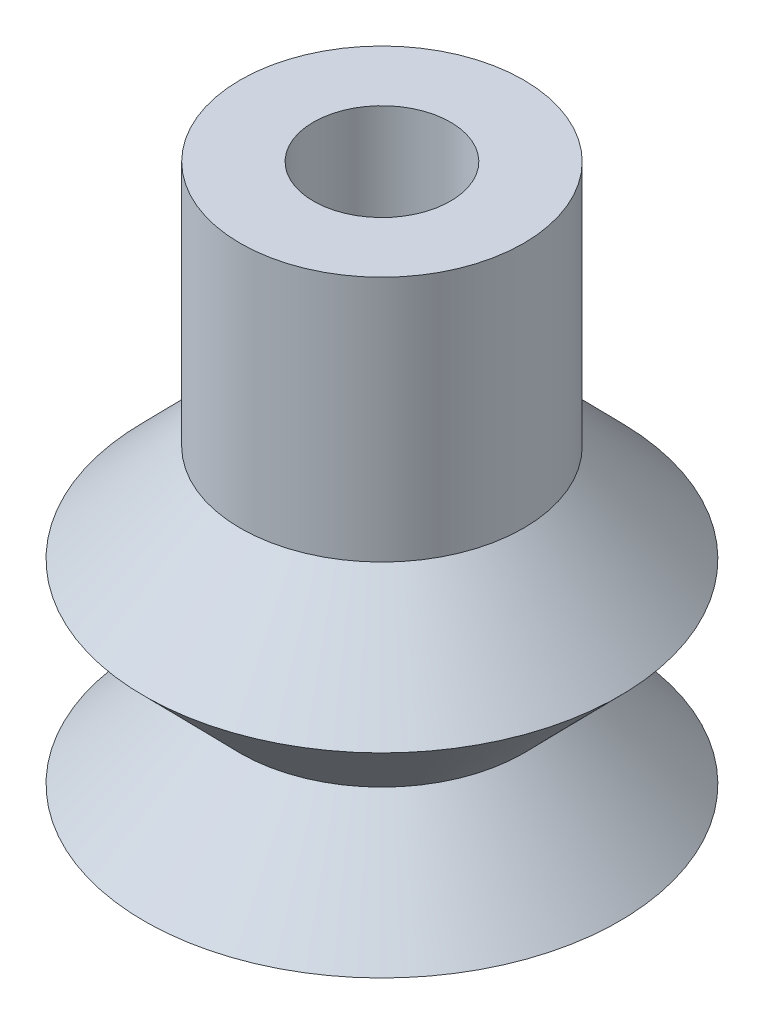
ISO-10303-21;
HEADER;
FILE_DESCRIPTION(('STEP AP214'),'2;1');
FILE_NAME('part.step','',(''),(''),'','','');
FILE_SCHEMA(('AUTOMOTIVE_DESIGN { 1 0 10303 214 1 1 1 1 }'));
ENDSEC;
DATA;
#1=APPLICATION_CONTEXT('core data for automotive mechanical design processes');
#2=APPLICATION_PROTOCOL_DEFINITION('international standard','automotive_design',2000,#1);
#3=PRODUCT_CONTEXT('',#1,'mechanical');
#4=PRODUCT('Part','Part','',(#3));
#5=PRODUCT_RELATED_PRODUCT_CATEGORY('part','',(#4));
#6=PRODUCT_DEFINITION_FORMATION('','',#4);
#7=PRODUCT_DEFINITION_CONTEXT('part definition',#1,'design');
#8=PRODUCT_DEFINITION('design','',#6,#7);
#9=PRODUCT_DEFINITION_SHAPE('','',#8);
#10=(LENGTH_UNIT() NAMED_UNIT(*) SI_UNIT(.MILLI.,.METRE.));
#11=(NAMED_UNIT(*) PLANE_ANGLE_UNIT() SI_UNIT($,.RADIAN.));
#12=(NAMED_UNIT(*) SI_UNIT($,.STERADIAN.) SOLID_ANGLE_UNIT());
#13=UNCERTAINTY_MEASURE_WITH_UNIT(LENGTH_MEASURE(1.E-05),#10,'distance_accuracy_value','');
#14=(GEOMETRIC_REPRESENTATION_CONTEXT(3) GLOBAL_UNCERTAINTY_ASSIGNED_CONTEXT((#13)) GLOBAL_UNIT_ASSIGNED_CONTEXT((#10,
#11,#12)) REPRESENTATION_CONTEXT('',''));
#15=CARTESIAN_POINT('',(0.,0.,0.));
#16=DIRECTION('',(0.,0.,1.));
#17=DIRECTION('',(1.,0.,0.));
#18=AXIS2_PLACEMENT_3D('',#15,#16,#17);
#19=CARTESIAN_POINT('',(3.937,14.986,0.));
#20=DIRECTION('',(0.,-1.,0.));
#21=DIRECTION('',(1.,0.,0.));
#22=AXIS2_PLACEMENT_3D('',#19,#20,#21);
#23=PLANE('',#22);
#24=CARTESIAN_POINT('',(0.,14.986,0.));
#25=DIRECTION('',(0.,1.,0.));
#26=DIRECTION('',(-1.,0.,0.));
#27=AXIS2_PLACEMENT_3D('',#24,#25,#26);
#28=CIRCLE('',#27,1.905);
#29=CARTESIAN_POINT('',(-1.905,14.986,0.));
#30=VERTEX_POINT('',#29);
#31=EDGE_CURVE('E10',#30,#30,#28,.T.);
#32=ORIENTED_EDGE('',*,*,#31,.F.);
#33=EDGE_LOOP('',(#32));
#34=FACE_BOUND('',#33,.T.);
#35=CARTESIAN_POINT('',(0.,14.986,0.));
#36=DIRECTION('',(0.,1.,0.));
#37=DIRECTION('',(-1.,0.,0.));
#38=AXIS2_PLACEMENT_3D('',#35,#36,#37);
#39=CIRCLE('',#38,3.937);
#40=CARTESIAN_POINT('',(-3.937,14.986,0.));
#41=VERTEX_POINT('',#40);
#42=EDGE_CURVE('E66',#41,#41,#39,.T.);
#43=ORIENTED_EDGE('',*,*,#42,.T.);
#44=EDGE_LOOP('',(#43));
#45=FACE_BOUND('',#44,.T.);
#46=ADVANCED_FACE('F32',(#34,#45),#23,.F.);
#47=CARTESIAN_POINT('',(0.,14.986,0.));
#48=DIRECTION('',(0.,1.,0.));
#49=DIRECTION('',(-1.,0.,0.));
#50=AXIS2_PLACEMENT_3D('',#47,#48,#49);
#51=CYLINDRICAL_SURFACE('',#50,1.905);
#52=CARTESIAN_POINT('',(0.,8.128,0.));
#53=DIRECTION('',(0.,1.,0.));
#54=DIRECTION('',(-1.,0.,0.));
#55=AXIS2_PLACEMENT_3D('',#52,#53,#54);
#56=CIRCLE('',#55,1.905);
#57=CARTESIAN_POINT('',(-1.905,8.128,0.));
#58=VERTEX_POINT('',#57);
#59=EDGE_CURVE('E38',#58,#58,#56,.T.);
#60=ORIENTED_EDGE('',*,*,#59,.F.);
#61=EDGE_LOOP('',(#60));
#62=FACE_BOUND('',#61,.T.);
#63=ORIENTED_EDGE('',*,*,#31,.T.);
#64=EDGE_LOOP('',(#63));
#65=FACE_BOUND('',#64,.T.);
#66=ADVANCED_FACE('F115',(#62,#65),#51,.F.);
#67=CARTESIAN_POINT('',(0.,8.128,0.));
#68=DIRECTION('',(0.,-1.,0.));
#69=DIRECTION('',(1.,0.,0.));
#70=AXIS2_PLACEMENT_3D('',#67,#68,#69);
#71=CONICAL_SURFACE('',#70,1.905,0.777524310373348);
#72=CARTESIAN_POINT('',(0.,5.41866666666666,0.));
#73=DIRECTION('',(0.,1.,0.));
#74=DIRECTION('',(-1.,0.,0.));
#75=AXIS2_PLACEMENT_3D('',#72,#73,#74);
#76=CIRCLE('',#75,4.572);
#77=CARTESIAN_POINT('',(-4.572,5.41866666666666,0.));
#78=VERTEX_POINT('',#77);
#79=EDGE_CURVE('E42',#78,#78,#76,.T.);
#80=ORIENTED_EDGE('',*,*,#79,.F.);
#81=EDGE_LOOP('',(#80));
#82=FACE_BOUND('',#81,.T.);
#83=ORIENTED_EDGE('',*,*,#59,.T.);
#84=EDGE_LOOP('',(#83));
#85=FACE_BOUND('',#84,.T.);
#86=ADVANCED_FACE('F110',(#82,#85),#71,.F.);
#87=CARTESIAN_POINT('',(0.,5.41866666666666,0.));
#88=DIRECTION('',(0.,1.,0.));
#89=DIRECTION('',(-1.,0.,0.));
#90=AXIS2_PLACEMENT_3D('',#87,#88,#89);
#91=CONICAL_SURFACE('',#90,4.572,0.777524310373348);
#92=CARTESIAN_POINT('',(0.,2.70933333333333,0.));
#93=DIRECTION('',(0.,1.,0.));
#94=DIRECTION('',(-1.,0.,0.));
#95=AXIS2_PLACEMENT_3D('',#92,#93,#94);
#96=CIRCLE('',#95,1.905);
#97=CARTESIAN_POINT('',(-1.905,2.70933333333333,0.));
#98=VERTEX_POINT('',#97);
#99=EDGE_CURVE('E46',#98,#98,#96,.T.);
#100=ORIENTED_EDGE('',*,*,#99,.F.);
#101=EDGE_LOOP('',(#100));
#102=FACE_BOUND('',#101,.T.);
#103=ORIENTED_EDGE('',*,*,#79,.T.);
#104=EDGE_LOOP('',(#103));
#105=FACE_BOUND('',#104,.T.);
#106=ADVANCED_FACE('F104',(#102,#105),#91,.F.);
#107=CARTESIAN_POINT('',(0.,2.70933333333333,0.));
#108=DIRECTION('',(0.,-1.,0.));
#109=DIRECTION('',(1.,0.,0.));
#110=AXIS2_PLACEMENT_3D('',#107,#108,#109);
#111=CONICAL_SURFACE('',#110,1.905,0.777524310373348);
#112=CARTESIAN_POINT('',(0.,0.,0.));
#113=DIRECTION('',(0.,1.,0.));
#114=DIRECTION('',(-1.,0.,0.));
#115=AXIS2_PLACEMENT_3D('',#112,#113,#114);
#116=CIRCLE('',#115,4.572);
#117=CARTESIAN_POINT('',(-4.572,0.,0.));
#118=VERTEX_POINT('',#117);
#119=EDGE_CURVE('E51',#118,#118,#116,.T.);
#120=ORIENTED_EDGE('',*,*,#119,.F.);
#121=EDGE_LOOP('',(#120));
#122=FACE_BOUND('',#121,.T.);
#123=ORIENTED_EDGE('',*,*,#99,.T.);
#124=EDGE_LOOP('',(#123));
#125=FACE_BOUND('',#124,.T.);
#126=ADVANCED_FACE('F98',(#122,#125),#111,.F.);
#127=CARTESIAN_POINT('',(6.604,0.,0.));
#128=DIRECTION('',(0.,1.,0.));
#129=DIRECTION('',(-1.,0.,0.));
#130=AXIS2_PLACEMENT_3D('',#127,#128,#129);
#131=PLANE('',#130);
#132=CARTESIAN_POINT('',(0.,0.,0.));
#133=DIRECTION('',(0.,1.,0.));
#134=DIRECTION('',(-1.,0.,0.));
#135=AXIS2_PLACEMENT_3D('',#132,#133,#134);
#136=CIRCLE('',#135,6.604);
#137=CARTESIAN_POINT('',(-6.604,0.,0.));
#138=VERTEX_POINT('',#137);
#139=EDGE_CURVE('E54',#138,#138,#136,.T.);
#140=ORIENTED_EDGE('',*,*,#139,.F.);
#141=EDGE_LOOP('',(#140));
#142=FACE_BOUND('',#141,.T.);
#143=ORIENTED_EDGE('',*,*,#119,.T.);
#144=EDGE_LOOP('',(#143));
#145=FACE_BOUND('',#144,.T.);
#146=ADVANCED_FACE('F92',(#142,#145),#131,.F.);
#147=CARTESIAN_POINT('',(0.,0.,0.));
#148=DIRECTION('',(0.,-1.,0.));
#149=DIRECTION('',(1.,0.,0.));
#150=AXIS2_PLACEMENT_3D('',#147,#148,#149);
#151=CONICAL_SURFACE('',#150,6.604,0.777524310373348);
#152=CARTESIAN_POINT('',(0.,2.70933333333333,0.));
#153=DIRECTION('',(0.,1.,0.));
#154=DIRECTION('',(-1.,0.,0.));
#155=AXIS2_PLACEMENT_3D('',#152,#153,#154);
#156=CIRCLE('',#155,3.937);
#157=CARTESIAN_POINT('',(-3.937,2.70933333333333,0.));
#158=VERTEX_POINT('',#157);
#159=EDGE_CURVE('E57',#158,#158,#156,.T.);
#160=ORIENTED_EDGE('',*,*,#159,.F.);
#161=EDGE_LOOP('',(#160));
#162=FACE_BOUND('',#161,.T.);
#163=ORIENTED_EDGE('',*,*,#139,.T.);
#164=EDGE_LOOP('',(#163));
#165=FACE_BOUND('',#164,.T.);
#166=ADVANCED_FACE('F86',(#162,#165),#151,.T.);
#167=CARTESIAN_POINT('',(0.,2.70933333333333,0.));
#168=DIRECTION('',(0.,1.,0.));
#169=DIRECTION('',(-1.,0.,0.));
#170=AXIS2_PLACEMENT_3D('',#167,#168,#169);
#171=CONICAL_SURFACE('',#170,3.937,0.777524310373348);
#172=CARTESIAN_POINT('',(0.,5.41866666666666,0.));
#173=DIRECTION('',(0.,1.,0.));
#174=DIRECTION('',(-1.,0.,0.));
#175=AXIS2_PLACEMENT_3D('',#172,#173,#174);
#176=CIRCLE('',#175,6.604);
#177=CARTESIAN_POINT('',(-6.604,5.41866666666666,0.));
#178=VERTEX_POINT('',#177);
#179=EDGE_CURVE('E60',#178,#178,#176,.T.);
#180=ORIENTED_EDGE('',*,*,#179,.F.);
#181=EDGE_LOOP('',(#180));
#182=FACE_BOUND('',#181,.T.);
#183=ORIENTED_EDGE('',*,*,#159,.T.);
#184=EDGE_LOOP('',(#183));
#185=FACE_BOUND('',#184,.T.);
#186=ADVANCED_FACE('F80',(#182,#185),#171,.T.);
#187=CARTESIAN_POINT('',(0.,5.41866666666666,0.));
#188=DIRECTION('',(0.,-1.,0.));
#189=DIRECTION('',(1.,0.,0.));
#190=AXIS2_PLACEMENT_3D('',#187,#188,#189);
#191=CONICAL_SURFACE('',#190,6.604,0.777524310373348);
#192=CARTESIAN_POINT('',(0.,8.128,0.));
#193=DIRECTION('',(0.,1.,0.));
#194=DIRECTION('',(-1.,0.,0.));
#195=AXIS2_PLACEMENT_3D('',#192,#193,#194);
#196=CIRCLE('',#195,3.937);
#197=CARTESIAN_POINT('',(-3.937,8.128,0.));
#198=VERTEX_POINT('',#197);
#199=EDGE_CURVE('E63',#198,#198,#196,.T.);
#200=ORIENTED_EDGE('',*,*,#199,.F.);
#201=EDGE_LOOP('',(#200));
#202=FACE_BOUND('',#201,.T.);
#203=ORIENTED_EDGE('',*,*,#179,.T.);
#204=EDGE_LOOP('',(#203));
#205=FACE_BOUND('',#204,.T.);
#206=ADVANCED_FACE('F74',(#202,#205),#191,.T.);
#207=CARTESIAN_POINT('',(0.,14.986,0.));
#208=DIRECTION('',(0.,1.,0.));
#209=DIRECTION('',(-1.,0.,0.));
#210=AXIS2_PLACEMENT_3D('',#207,#208,#209);
#211=CYLINDRICAL_SURFACE('',#210,3.937);
#212=ORIENTED_EDGE('',*,*,#42,.F.);
#213=EDGE_LOOP('',(#212));
#214=FACE_BOUND('',#213,.T.);
#215=ORIENTED_EDGE('',*,*,#199,.T.);
#216=EDGE_LOOP('',(#215));
#217=FACE_BOUND('',#216,.T.);
#218=ADVANCED_FACE('F71',(#214,#217),#211,.T.);
#219=CLOSED_SHELL('',(#46,#66,#86,#106,#126,#146,#166,#186,#206,#218));
#220=MANIFOLD_SOLID_BREP('B2',#219);
#221=ADVANCED_BREP_SHAPE_REPRESENTATION('',(#18,#220),#14);
#222=SHAPE_DEFINITION_REPRESENTATION(#9,#221);
ENDSEC;
END-ISO-10303-21;
